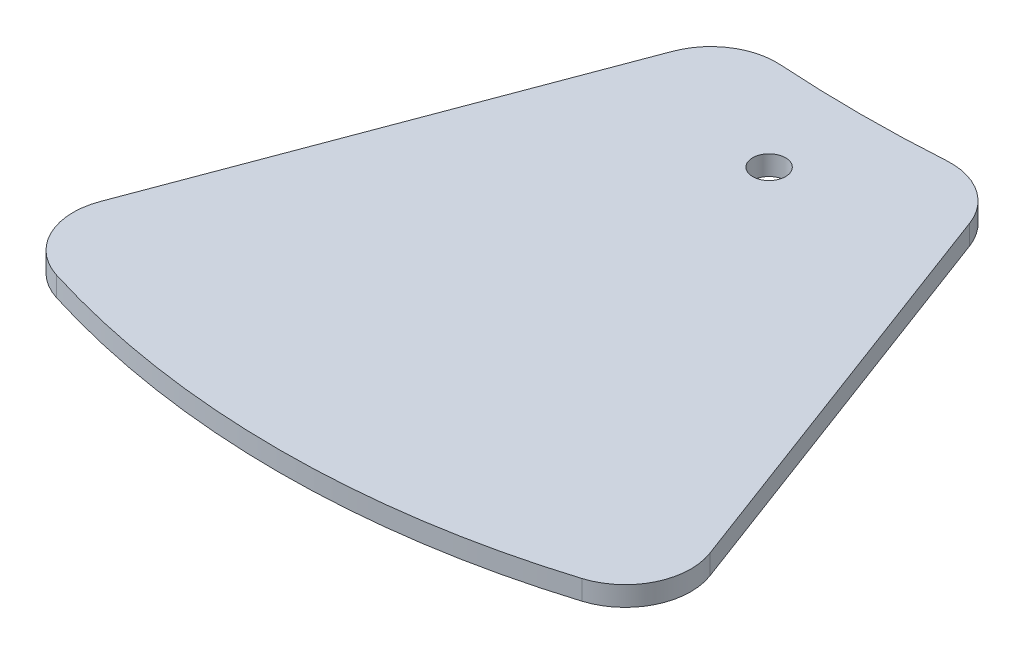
ISO-10303-21;
HEADER;
FILE_DESCRIPTION(('STEP AP214'),'2;1');
FILE_NAME('part.step','',(''),(''),'','','');
FILE_SCHEMA(('AUTOMOTIVE_DESIGN { 1 0 10303 214 1 1 1 1 }'));
ENDSEC;
DATA;
#1=APPLICATION_CONTEXT('core data for automotive mechanical design processes');
#2=APPLICATION_PROTOCOL_DEFINITION('international standard','automotive_design',2000,#1);
#3=PRODUCT_CONTEXT('',#1,'mechanical');
#4=PRODUCT('Part','Part','',(#3));
#5=PRODUCT_RELATED_PRODUCT_CATEGORY('part','',(#4));
#6=PRODUCT_DEFINITION_FORMATION('','',#4);
#7=PRODUCT_DEFINITION_CONTEXT('part definition',#1,'design');
#8=PRODUCT_DEFINITION('design','',#6,#7);
#9=PRODUCT_DEFINITION_SHAPE('','',#8);
#10=(LENGTH_UNIT() NAMED_UNIT(*) SI_UNIT(.MILLI.,.METRE.));
#11=(NAMED_UNIT(*) PLANE_ANGLE_UNIT() SI_UNIT($,.RADIAN.));
#12=(NAMED_UNIT(*) SI_UNIT($,.STERADIAN.) SOLID_ANGLE_UNIT());
#13=UNCERTAINTY_MEASURE_WITH_UNIT(LENGTH_MEASURE(1.E-05),#10,'distance_accuracy_value','');
#14=(GEOMETRIC_REPRESENTATION_CONTEXT(3) GLOBAL_UNCERTAINTY_ASSIGNED_CONTEXT((#13)) GLOBAL_UNIT_ASSIGNED_CONTEXT((#10,
#11,#12)) REPRESENTATION_CONTEXT('',''));
#15=CARTESIAN_POINT('',(0.,0.,0.));
#16=DIRECTION('',(0.,0.,1.));
#17=DIRECTION('',(1.,0.,0.));
#18=AXIS2_PLACEMENT_3D('',#15,#16,#17);
#19=CARTESIAN_POINT('',(0.,3.,-207.520859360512));
#20=DIRECTION('',(0.,1.,0.));
#21=DIRECTION('',(0.,0.,1.));
#22=AXIS2_PLACEMENT_3D('',#19,#20,#21);
#23=PLANE('',#22);
#24=DIRECTION('',(-0.351123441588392,0.,-0.936329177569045));
#25=VECTOR('',#24,1.);
#26=CARTESIAN_POINT('',(50.,3.,65.));
#27=LINE('',#26,#25);
#28=CARTESIAN_POINT('',(46.4265032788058,3.,55.4706754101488));
#29=VERTEX_POINT('',#28);
#30=CARTESIAN_POINT('',(22.6588090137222,3.,-7.9098426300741));
#31=VERTEX_POINT('',#30);
#32=EDGE_CURVE('E135',#29,#31,#27,.T.);
#33=ORIENTED_EDGE('',*,*,#32,.T.);
#34=CARTESIAN_POINT('',(13.2955172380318,3.,-4.39860821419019));
#35=DIRECTION('',(0.,1.,0.));
#36=DIRECTION('',(0.,0.,1.));
#37=AXIS2_PLACEMENT_3D('',#34,#35,#36);
#38=CIRCLE('',#37,10.);
#39=CARTESIAN_POINT('',(12.6423575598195,3.,-14.3772545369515));
#40=VERTEX_POINT('',#39);
#41=EDGE_CURVE('E154',#31,#40,#38,.T.);
#42=ORIENTED_EDGE('',*,*,#41,.T.);
#43=CARTESIAN_POINT('',(0.,3.,-207.520859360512));
#44=DIRECTION('',(0.,-1.,0.));
#45=DIRECTION('',(0.,0.,1.));
#46=AXIS2_PLACEMENT_3D('',#43,#44,#45);
#47=CIRCLE('',#46,193.55692002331);
#48=CARTESIAN_POINT('',(-12.6423575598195,3.,-14.3772545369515));
#49=VERTEX_POINT('',#48);
#50=EDGE_CURVE('E118',#40,#49,#47,.T.);
#51=ORIENTED_EDGE('',*,*,#50,.T.);
#52=CARTESIAN_POINT('',(-13.2955172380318,3.,-4.39860821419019));
#53=DIRECTION('',(0.,1.,0.));
#54=DIRECTION('',(0.,0.,1.));
#55=AXIS2_PLACEMENT_3D('',#52,#53,#54);
#56=CIRCLE('',#55,10.);
#57=CARTESIAN_POINT('',(-22.6588090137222,3.,-7.9098426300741));
#58=VERTEX_POINT('',#57);
#59=EDGE_CURVE('E152',#49,#58,#56,.T.);
#60=ORIENTED_EDGE('',*,*,#59,.T.);
#61=DIRECTION('',(-0.351123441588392,0.,0.936329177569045));
#62=VECTOR('',#61,1.);
#63=CARTESIAN_POINT('',(-20.,3.,-15.));
#64=LINE('',#63,#62);
#65=CARTESIAN_POINT('',(-46.4265032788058,3.,55.4706754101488));
#66=VERTEX_POINT('',#65);
#67=EDGE_CURVE('E174',#58,#66,#64,.T.);
#68=ORIENTED_EDGE('',*,*,#67,.T.);
#69=CARTESIAN_POINT('',(-37.0632115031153,3.,58.9819098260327));
#70=DIRECTION('',(0.,1.,0.));
#71=DIRECTION('',(0.,0.,1.));
#72=AXIS2_PLACEMENT_3D('',#69,#70,#71);
#73=CIRCLE('',#72,10.);
#74=CARTESIAN_POINT('',(-40.0301888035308,3.,68.5316242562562));
#75=VERTEX_POINT('',#74);
#76=EDGE_CURVE('E53',#66,#75,#73,.T.);
#77=ORIENTED_EDGE('',*,*,#76,.T.);
#78=CARTESIAN_POINT('',(0.,3.,-60.3122572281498));
#79=DIRECTION('',(0.,1.,0.));
#80=DIRECTION('',(0.,0.,1.));
#81=AXIS2_PLACEMENT_3D('',#78,#79,#80);
#82=CIRCLE('',#81,134.919093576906);
#83=CARTESIAN_POINT('',(40.0301888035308,3.,68.5316242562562));
#84=VERTEX_POINT('',#83);
#85=EDGE_CURVE('E164',#75,#84,#82,.T.);
#86=ORIENTED_EDGE('',*,*,#85,.T.);
#87=CARTESIAN_POINT('',(37.0632115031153,3.,58.9819098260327));
#88=DIRECTION('',(0.,1.,0.));
#89=DIRECTION('',(0.,0.,1.));
#90=AXIS2_PLACEMENT_3D('',#87,#88,#89);
#91=CIRCLE('',#90,10.);
#92=EDGE_CURVE('E150',#84,#29,#91,.T.);
#93=ORIENTED_EDGE('',*,*,#92,.T.);
#94=EDGE_LOOP('',(#33,#42,#51,#60,#68,#77,#86,#93));
#95=FACE_BOUND('',#94,.T.);
#96=CARTESIAN_POINT('',(0.,3.,0.));
#97=DIRECTION('',(0.,1.,0.));
#98=DIRECTION('',(0.,0.,1.));
#99=AXIS2_PLACEMENT_3D('',#96,#97,#98);
#100=CIRCLE('',#99,2.5);
#101=CARTESIAN_POINT('',(0.,3.,2.5));
#102=VERTEX_POINT('',#101);
#103=EDGE_CURVE('E126',#102,#102,#100,.T.);
#104=ORIENTED_EDGE('',*,*,#103,.F.);
#105=EDGE_LOOP('',(#104));
#106=FACE_BOUND('',#105,.T.);
#107=ADVANCED_FACE('F33',(#95,#106),#23,.T.);
#108=CARTESIAN_POINT('',(0.,0.,-207.520859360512));
#109=DIRECTION('',(0.,1.,0.));
#110=DIRECTION('',(0.,0.,1.));
#111=AXIS2_PLACEMENT_3D('',#108,#109,#110);
#112=PLANE('',#111);
#113=CARTESIAN_POINT('',(0.,0.,-207.520859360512));
#114=DIRECTION('',(0.,-1.,0.));
#115=DIRECTION('',(0.,0.,1.));
#116=AXIS2_PLACEMENT_3D('',#113,#114,#115);
#117=CIRCLE('',#116,193.55692002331);
#118=CARTESIAN_POINT('',(12.6423575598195,0.,-14.3772545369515));
#119=VERTEX_POINT('',#118);
#120=CARTESIAN_POINT('',(-12.6423575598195,0.,-14.3772545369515));
#121=VERTEX_POINT('',#120);
#122=EDGE_CURVE('E115',#119,#121,#117,.T.);
#123=ORIENTED_EDGE('',*,*,#122,.F.);
#124=CARTESIAN_POINT('',(13.2955172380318,0.,-4.39860821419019));
#125=DIRECTION('',(0.,1.,0.));
#126=DIRECTION('',(0.,0.,1.));
#127=AXIS2_PLACEMENT_3D('',#124,#125,#126);
#128=CIRCLE('',#127,10.);
#129=CARTESIAN_POINT('',(22.6588090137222,0.,-7.9098426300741));
#130=VERTEX_POINT('',#129);
#131=EDGE_CURVE('E98',#119,#130,#128,.F.);
#132=ORIENTED_EDGE('',*,*,#131,.T.);
#133=DIRECTION('',(-0.351123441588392,0.,-0.936329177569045));
#134=VECTOR('',#133,1.);
#135=CARTESIAN_POINT('',(50.,0.,65.));
#136=LINE('',#135,#134);
#137=CARTESIAN_POINT('',(46.4265032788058,0.,55.4706754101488));
#138=VERTEX_POINT('',#137);
#139=EDGE_CURVE('E139',#138,#130,#136,.T.);
#140=ORIENTED_EDGE('',*,*,#139,.F.);
#141=CARTESIAN_POINT('',(37.0632115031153,0.,58.9819098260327));
#142=DIRECTION('',(0.,1.,0.));
#143=DIRECTION('',(0.,0.,1.));
#144=AXIS2_PLACEMENT_3D('',#141,#142,#143);
#145=CIRCLE('',#144,10.);
#146=CARTESIAN_POINT('',(40.0301888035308,0.,68.5316242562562));
#147=VERTEX_POINT('',#146);
#148=EDGE_CURVE('E143',#138,#147,#145,.F.);
#149=ORIENTED_EDGE('',*,*,#148,.T.);
#150=CARTESIAN_POINT('',(0.,0.,-60.3122572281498));
#151=DIRECTION('',(0.,1.,0.));
#152=DIRECTION('',(0.,0.,1.));
#153=AXIS2_PLACEMENT_3D('',#150,#151,#152);
#154=CIRCLE('',#153,134.919093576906);
#155=CARTESIAN_POINT('',(-40.0301888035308,0.,68.5316242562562));
#156=VERTEX_POINT('',#155);
#157=EDGE_CURVE('E129',#156,#147,#154,.T.);
#158=ORIENTED_EDGE('',*,*,#157,.F.);
#159=CARTESIAN_POINT('',(-37.0632115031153,0.,58.9819098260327));
#160=DIRECTION('',(0.,1.,0.));
#161=DIRECTION('',(0.,0.,1.));
#162=AXIS2_PLACEMENT_3D('',#159,#160,#161);
#163=CIRCLE('',#162,10.);
#164=CARTESIAN_POINT('',(-46.4265032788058,0.,55.4706754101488));
#165=VERTEX_POINT('',#164);
#166=EDGE_CURVE('E119',#156,#165,#163,.F.);
#167=ORIENTED_EDGE('',*,*,#166,.T.);
#168=DIRECTION('',(-0.351123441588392,0.,0.936329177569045));
#169=VECTOR('',#168,1.);
#170=CARTESIAN_POINT('',(-20.,0.,-15.));
#171=LINE('',#170,#169);
#172=CARTESIAN_POINT('',(-22.6588090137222,0.,-7.9098426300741));
#173=VERTEX_POINT('',#172);
#174=EDGE_CURVE('E125',#173,#165,#171,.T.);
#175=ORIENTED_EDGE('',*,*,#174,.F.);
#176=CARTESIAN_POINT('',(-13.2955172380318,0.,-4.39860821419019));
#177=DIRECTION('',(0.,1.,0.));
#178=DIRECTION('',(0.,0.,1.));
#179=AXIS2_PLACEMENT_3D('',#176,#177,#178);
#180=CIRCLE('',#179,10.);
#181=EDGE_CURVE('E109',#173,#121,#180,.F.);
#182=ORIENTED_EDGE('',*,*,#181,.T.);
#183=EDGE_LOOP('',(#123,#132,#140,#149,#158,#167,#175,#182));
#184=FACE_BOUND('',#183,.T.);
#185=CARTESIAN_POINT('',(0.,0.,0.));
#186=DIRECTION('',(0.,1.,0.));
#187=DIRECTION('',(0.,0.,1.));
#188=AXIS2_PLACEMENT_3D('',#185,#186,#187);
#189=CIRCLE('',#188,2.5);
#190=CARTESIAN_POINT('',(0.,0.,2.5));
#191=VERTEX_POINT('',#190);
#192=EDGE_CURVE('E132',#191,#191,#189,.T.);
#193=ORIENTED_EDGE('',*,*,#192,.T.);
#194=EDGE_LOOP('',(#193));
#195=FACE_BOUND('',#194,.T.);
#196=ADVANCED_FACE('F122',(#184,#195),#112,.F.);
#197=CARTESIAN_POINT('',(0.,3.,-207.520859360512));
#198=DIRECTION('',(0.,-1.,0.));
#199=DIRECTION('',(0.,0.,-1.));
#200=AXIS2_PLACEMENT_3D('',#197,#198,#199);
#201=CYLINDRICAL_SURFACE('',#200,193.55692002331);
#202=ORIENTED_EDGE('',*,*,#50,.F.);
#203=DIRECTION('',(0.,-1.,0.));
#204=VECTOR('',#203,1.);
#205=CARTESIAN_POINT('',(12.6423575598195,3.,-14.3772545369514));
#206=LINE('',#205,#204);
#207=EDGE_CURVE('E102',#40,#119,#206,.T.);
#208=ORIENTED_EDGE('',*,*,#207,.T.);
#209=ORIENTED_EDGE('',*,*,#122,.T.);
#210=DIRECTION('',(0.,-1.,0.));
#211=VECTOR('',#210,1.);
#212=CARTESIAN_POINT('',(-12.6423575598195,3.,-14.3772545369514));
#213=LINE('',#212,#211);
#214=EDGE_CURVE('E120',#121,#49,#213,.F.);
#215=ORIENTED_EDGE('',*,*,#214,.T.);
#216=EDGE_LOOP('',(#202,#208,#209,#215));
#217=FACE_BOUND('',#216,.T.);
#218=ADVANCED_FACE('F114',(#217),#201,.F.);
#219=CARTESIAN_POINT('',(-20.,3.,-15.));
#220=DIRECTION('',(0.936329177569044,0.,0.351123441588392));
#221=DIRECTION('',(0.351123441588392,0.,-0.936329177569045));
#222=AXIS2_PLACEMENT_3D('',#219,#220,#221);
#223=PLANE('',#222);
#224=ORIENTED_EDGE('',*,*,#67,.F.);
#225=DIRECTION('',(0.,-1.,0.));
#226=VECTOR('',#225,1.);
#227=CARTESIAN_POINT('',(-22.6588090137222,3.,-7.9098426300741));
#228=LINE('',#227,#226);
#229=EDGE_CURVE('E158',#58,#173,#228,.T.);
#230=ORIENTED_EDGE('',*,*,#229,.T.);
#231=ORIENTED_EDGE('',*,*,#174,.T.);
#232=DIRECTION('',(0.,-1.,0.));
#233=VECTOR('',#232,1.);
#234=CARTESIAN_POINT('',(-46.4265032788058,3.,55.4706754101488));
#235=LINE('',#234,#233);
#236=EDGE_CURVE('E156',#165,#66,#235,.F.);
#237=ORIENTED_EDGE('',*,*,#236,.T.);
#238=EDGE_LOOP('',(#224,#230,#231,#237));
#239=FACE_BOUND('',#238,.T.);
#240=ADVANCED_FACE('F202',(#239),#223,.F.);
#241=CARTESIAN_POINT('',(0.,3.,-60.3122572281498));
#242=DIRECTION('',(0.,-1.,0.));
#243=DIRECTION('',(0.,0.,-1.));
#244=AXIS2_PLACEMENT_3D('',#241,#242,#243);
#245=CYLINDRICAL_SURFACE('',#244,134.919093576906);
#246=ORIENTED_EDGE('',*,*,#157,.T.);
#247=DIRECTION('',(0.,-1.,0.));
#248=VECTOR('',#247,1.);
#249=CARTESIAN_POINT('',(40.0301888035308,3.,68.5316242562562));
#250=LINE('',#249,#248);
#251=EDGE_CURVE('E11',#147,#84,#250,.F.);
#252=ORIENTED_EDGE('',*,*,#251,.T.);
#253=ORIENTED_EDGE('',*,*,#85,.F.);
#254=DIRECTION('',(0.,-1.,0.));
#255=VECTOR('',#254,1.);
#256=CARTESIAN_POINT('',(-40.0301888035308,3.,68.5316242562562));
#257=LINE('',#256,#255);
#258=EDGE_CURVE('E41',#75,#156,#257,.T.);
#259=ORIENTED_EDGE('',*,*,#258,.T.);
#260=EDGE_LOOP('',(#246,#252,#253,#259));
#261=FACE_BOUND('',#260,.T.);
#262=ADVANCED_FACE('F163',(#261),#245,.T.);
#263=CARTESIAN_POINT('',(50.,3.,65.));
#264=DIRECTION('',(-0.936329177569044,0.,0.351123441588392));
#265=DIRECTION('',(0.351123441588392,0.,0.936329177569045));
#266=AXIS2_PLACEMENT_3D('',#263,#264,#265);
#267=PLANE('',#266);
#268=ORIENTED_EDGE('',*,*,#139,.T.);
#269=DIRECTION('',(0.,-1.,0.));
#270=VECTOR('',#269,1.);
#271=CARTESIAN_POINT('',(22.6588090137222,3.,-7.9098426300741));
#272=LINE('',#271,#270);
#273=EDGE_CURVE('E103',#130,#31,#272,.F.);
#274=ORIENTED_EDGE('',*,*,#273,.T.);
#275=ORIENTED_EDGE('',*,*,#32,.F.);
#276=DIRECTION('',(0.,-1.,0.));
#277=VECTOR('',#276,1.);
#278=CARTESIAN_POINT('',(46.4265032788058,3.,55.4706754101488));
#279=LINE('',#278,#277);
#280=EDGE_CURVE('E108',#29,#138,#279,.T.);
#281=ORIENTED_EDGE('',*,*,#280,.T.);
#282=EDGE_LOOP('',(#268,#274,#275,#281));
#283=FACE_BOUND('',#282,.T.);
#284=ADVANCED_FACE('F172',(#283),#267,.F.);
#285=CARTESIAN_POINT('',(0.,3.,0.));
#286=DIRECTION('',(0.,-1.,0.));
#287=DIRECTION('',(0.,0.,-1.));
#288=AXIS2_PLACEMENT_3D('',#285,#286,#287);
#289=CYLINDRICAL_SURFACE('',#288,2.5);
#290=ORIENTED_EDGE('',*,*,#103,.T.);
#291=EDGE_LOOP('',(#290));
#292=FACE_BOUND('',#291,.T.);
#293=ORIENTED_EDGE('',*,*,#192,.F.);
#294=EDGE_LOOP('',(#293));
#295=FACE_BOUND('',#294,.T.);
#296=ADVANCED_FACE('F181',(#292,#295),#289,.F.);
#297=CARTESIAN_POINT('',(13.2955172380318,3.,-4.39860821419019));
#298=DIRECTION('',(0.,-1.,0.));
#299=DIRECTION('',(0.,0.,-1.));
#300=AXIS2_PLACEMENT_3D('',#297,#298,#299);
#301=CYLINDRICAL_SURFACE('',#300,10.);
#302=ORIENTED_EDGE('',*,*,#41,.F.);
#303=ORIENTED_EDGE('',*,*,#273,.F.);
#304=ORIENTED_EDGE('',*,*,#131,.F.);
#305=ORIENTED_EDGE('',*,*,#207,.F.);
#306=EDGE_LOOP('',(#302,#303,#304,#305));
#307=FACE_BOUND('',#306,.T.);
#308=ADVANCED_FACE('F101',(#307),#301,.T.);
#309=CARTESIAN_POINT('',(-13.2955172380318,3.,-4.39860821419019));
#310=DIRECTION('',(0.,-1.,0.));
#311=DIRECTION('',(0.,0.,-1.));
#312=AXIS2_PLACEMENT_3D('',#309,#310,#311);
#313=CYLINDRICAL_SURFACE('',#312,10.);
#314=ORIENTED_EDGE('',*,*,#59,.F.);
#315=ORIENTED_EDGE('',*,*,#214,.F.);
#316=ORIENTED_EDGE('',*,*,#181,.F.);
#317=ORIENTED_EDGE('',*,*,#229,.F.);
#318=EDGE_LOOP('',(#314,#315,#316,#317));
#319=FACE_BOUND('',#318,.T.);
#320=ADVANCED_FACE('F189',(#319),#313,.T.);
#321=CARTESIAN_POINT('',(37.0632115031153,3.,58.9819098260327));
#322=DIRECTION('',(0.,-1.,0.));
#323=DIRECTION('',(0.,0.,-1.));
#324=AXIS2_PLACEMENT_3D('',#321,#322,#323);
#325=CYLINDRICAL_SURFACE('',#324,10.);
#326=ORIENTED_EDGE('',*,*,#92,.F.);
#327=ORIENTED_EDGE('',*,*,#251,.F.);
#328=ORIENTED_EDGE('',*,*,#148,.F.);
#329=ORIENTED_EDGE('',*,*,#280,.F.);
#330=EDGE_LOOP('',(#326,#327,#328,#329));
#331=FACE_BOUND('',#330,.T.);
#332=ADVANCED_FACE('F169',(#331),#325,.T.);
#333=CARTESIAN_POINT('',(-37.0632115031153,3.,58.9819098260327));
#334=DIRECTION('',(0.,-1.,0.));
#335=DIRECTION('',(0.,0.,-1.));
#336=AXIS2_PLACEMENT_3D('',#333,#334,#335);
#337=CYLINDRICAL_SURFACE('',#336,10.);
#338=ORIENTED_EDGE('',*,*,#76,.F.);
#339=ORIENTED_EDGE('',*,*,#236,.F.);
#340=ORIENTED_EDGE('',*,*,#166,.F.);
#341=ORIENTED_EDGE('',*,*,#258,.F.);
#342=EDGE_LOOP('',(#338,#339,#340,#341));
#343=FACE_BOUND('',#342,.T.);
#344=ADVANCED_FACE('F35',(#343),#337,.T.);
#345=CLOSED_SHELL('',(#107,#196,#218,#240,#262,#284,#296,#308,#320,#332,#344));
#346=MANIFOLD_SOLID_BREP('B2',#345);
#347=ADVANCED_BREP_SHAPE_REPRESENTATION('',(#18,#346),#14);
#348=SHAPE_DEFINITION_REPRESENTATION(#9,#347);
ENDSEC;
END-ISO-10303-21;
